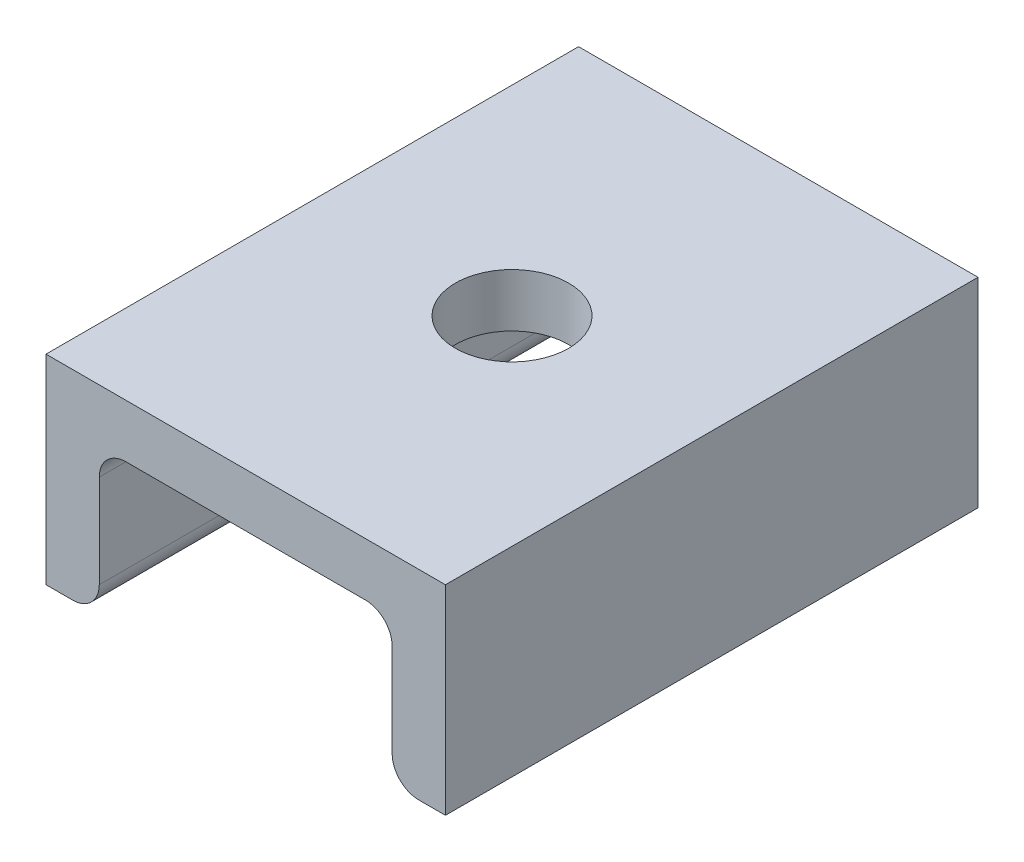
from build123d import *

# Parameters (mm, degrees)
BOSS_EXTRU_1_DEPTH      = 40
ESQUISSE2_R             = 4.25
ENL_V_MAT_EXTRU_1_DEPTH = 45.11349


with BuildPart() as part:
    # Esquisse1 → Boss.-Extru.1 (new body)
    with BuildSketch(Plane(origin=(0, 0, 0), x_dir=(-1, 0, 0), z_dir=(0, 0, 1))):
        with BuildLine():
            Line((-15, 15), (-15, 0))
            Line((-15, 0), (15, 0))
            Line((15, 0), (15, 15))
            Line((15, 15), (13, 15))
            ThreePointArc((13, 15), (11.585786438, 14.414213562), (11, 13))
            Line((11, 13), (11, 6))
            ThreePointArc((11, 6), (10.414213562, 4.585786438), (9, 4))
            Line((9, 4), (-9, 4))
            ThreePointArc((-9, 4), (-10.414213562, 4.585786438), (-11, 6))
            Line((-11, 6), (-11, 13))
            ThreePointArc((-11, 13), (-11.585786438, 14.414213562), (-13, 15))
            Line((-13, 15), (-15, 15))
        make_face()
    extrude(amount=BOSS_EXTRU_1_DEPTH)

    # Esquisse2 → Enl_v. mat.-Extru.1 (cut, through all)
    with BuildSketch(Plane.XZ.offset(4)):
        with Locations((0, 20)):
            Circle(ESQUISSE2_R)
    extrude(amount=-ENL_V_MAT_EXTRU_1_DEPTH, mode=Mode.SUBTRACT)


solid = part.part
